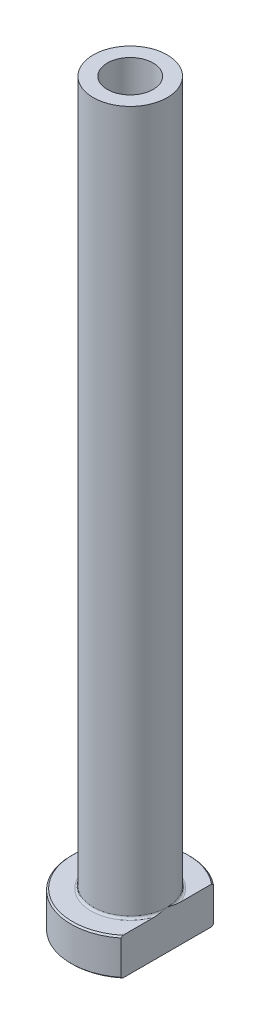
from build123d import *

# Parameters (mm, degrees)
FILLET1_R          = 0.3
CHAMFER1_SIZE      = 0.2
CUT_EXTRUDE1_DEPTH = 101.637965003
CHAMFER2_SIZE      = 0.5


with BuildPart() as part:
    # Sketch1 → Revolve1 (revolve)
    with BuildSketch(Plane.XY, mode=Mode.PRIVATE) as revolve1_sk:
        Polygon((-3.1, 100), (-5, 100), (-5, 5), (-8, 5), (-8, 0), (-3.35, 0), (-3.35, 43), (-3.1, 55), align=None)
    revolve(revolve1_sk.sketch.rotate(Axis((0, 92.187680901, 0), (0, -1, 0)), 270), axis=Axis((0, 92.187680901, 0), (0, -1, 0)))

    # Fillet1
    fillet1_edges = [part.edges().sort_by_distance(p)[0] for p in [
        (0, 5, -5),
    ]]
    fillet(fillet1_edges, radius=FILLET1_R)

    # Chamfer1
    chamfer1_edges = [part.edges().sort_by_distance(p)[0] for p in [
        (0, 0, -8),
        (0, 5, -8),
    ]]
    chamfer(chamfer1_edges, length=CHAMFER1_SIZE)

    # Sketch2 → Cut-Extrude1 (cut, through all)
    with BuildSketch(Plane.XZ):
        with BuildLine():
            Line((5, 6.244997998), (5, -6.244997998))
            ThreePointArc((5, -6.244997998), (8, 0), (5, 6.244997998))
        make_face()
    extrude(amount=-CUT_EXTRUDE1_DEPTH, mode=Mode.SUBTRACT)

    # Chamfer2
    chamfer2_edges = [part.edges().sort_by_distance(p)[0] for p in [
        (0, 0, -3.35),
    ]]
    chamfer(chamfer2_edges, length=CHAMFER2_SIZE)


solid = part.part
